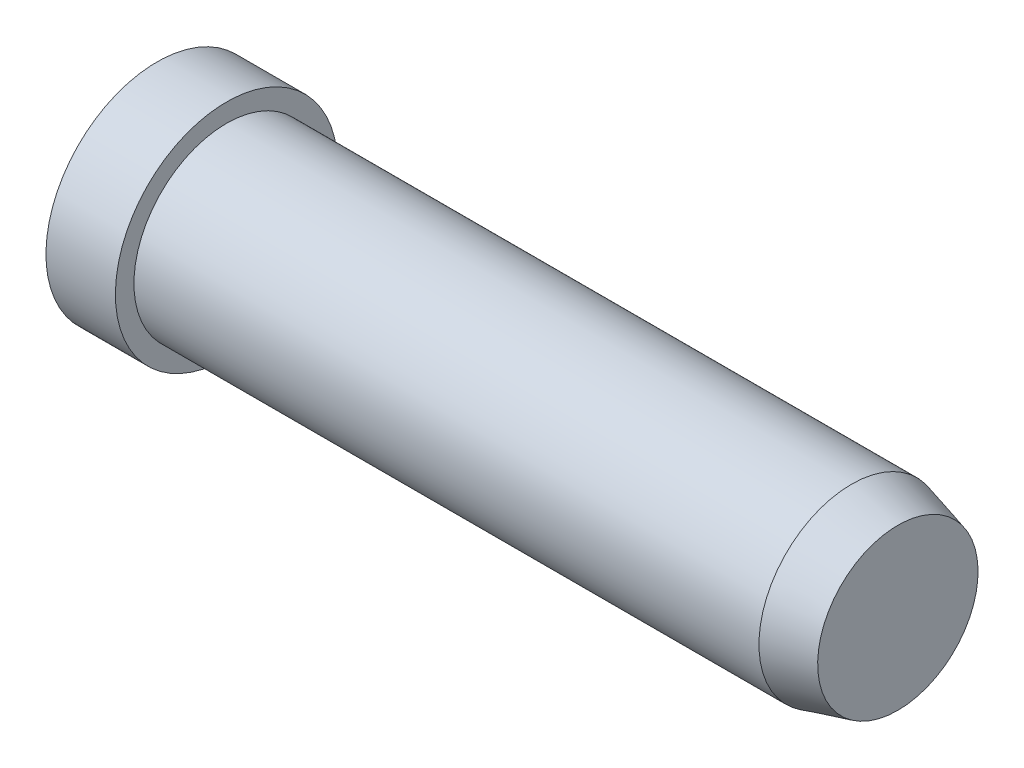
from build123d import *


with BuildPart() as part:
    # Sketch1 → Revolve1 (revolve)
    with BuildSketch(Plane.XY, mode=Mode.PRIVATE) as revolve1_sk:
        Polygon((0, 0), (0, 24), (15, 24), (15, 20), (150, 20), (160, 17.320508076), (160, 0), align=None)
    revolve(revolve1_sk.sketch.rotate(Axis((160, 0, 0), (-1, 0, 0)), 180), axis=Axis((160, 0, 0), (-1, 0, 0)))


solid = part.part
